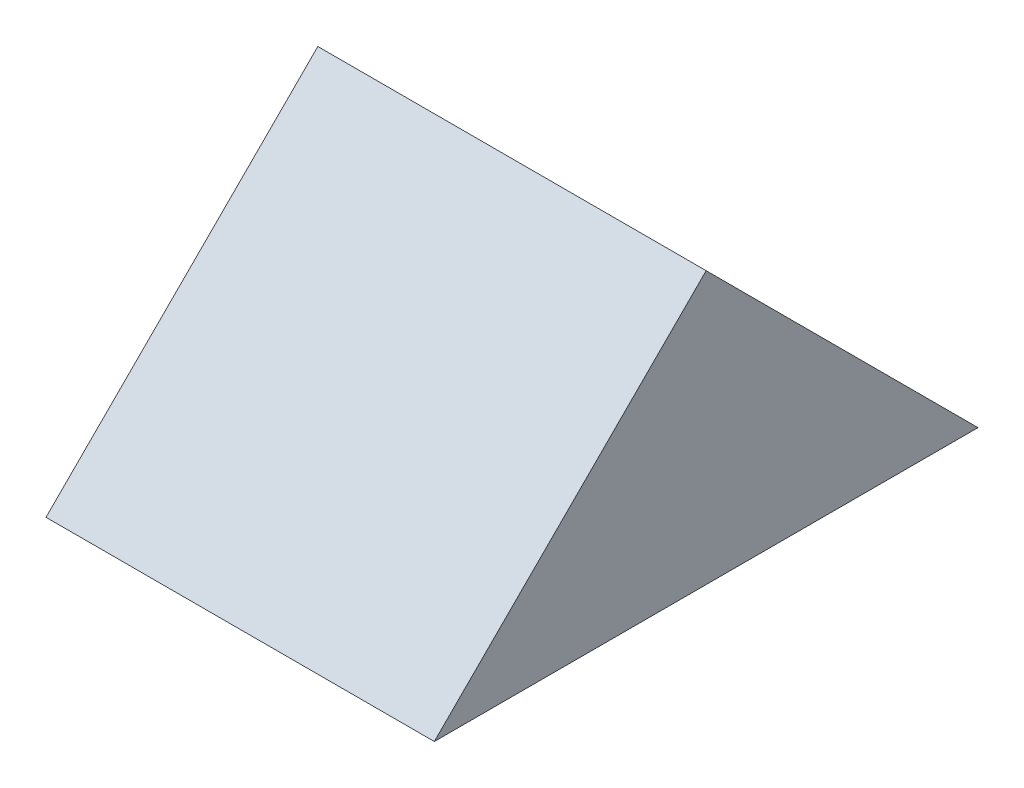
ISO-10303-21;
HEADER;
FILE_DESCRIPTION(('STEP AP214'),'2;1');
FILE_NAME('part.step','',(''),(''),'','','');
FILE_SCHEMA(('AUTOMOTIVE_DESIGN { 1 0 10303 214 1 1 1 1 }'));
ENDSEC;
DATA;
#1=APPLICATION_CONTEXT('core data for automotive mechanical design processes');
#2=APPLICATION_PROTOCOL_DEFINITION('international standard','automotive_design',2000,#1);
#3=PRODUCT_CONTEXT('',#1,'mechanical');
#4=PRODUCT('Part','Part','',(#3));
#5=PRODUCT_RELATED_PRODUCT_CATEGORY('part','',(#4));
#6=PRODUCT_DEFINITION_FORMATION('','',#4);
#7=PRODUCT_DEFINITION_CONTEXT('part definition',#1,'design');
#8=PRODUCT_DEFINITION('design','',#6,#7);
#9=PRODUCT_DEFINITION_SHAPE('','',#8);
#10=(LENGTH_UNIT() NAMED_UNIT(*) SI_UNIT(.MILLI.,.METRE.));
#11=(NAMED_UNIT(*) PLANE_ANGLE_UNIT() SI_UNIT($,.RADIAN.));
#12=(NAMED_UNIT(*) SI_UNIT($,.STERADIAN.) SOLID_ANGLE_UNIT());
#13=UNCERTAINTY_MEASURE_WITH_UNIT(LENGTH_MEASURE(1.E-05),#10,'distance_accuracy_value','');
#14=(GEOMETRIC_REPRESENTATION_CONTEXT(3) GLOBAL_UNCERTAINTY_ASSIGNED_CONTEXT((#13)) GLOBAL_UNIT_ASSIGNED_CONTEXT((#10,
#11,#12)) REPRESENTATION_CONTEXT('',''));
#15=CARTESIAN_POINT('',(0.,0.,0.));
#16=DIRECTION('',(0.,0.,1.));
#17=DIRECTION('',(1.,0.,0.));
#18=AXIS2_PLACEMENT_3D('',#15,#16,#17);
#19=CARTESIAN_POINT('',(12.5,0.,0.));
#20=DIRECTION('',(0.,1.,0.));
#21=DIRECTION('',(0.,0.,1.));
#22=AXIS2_PLACEMENT_3D('',#19,#20,#21);
#23=PLANE('',#22);
#24=DIRECTION('',(0.,0.,-1.));
#25=VECTOR('',#24,1.);
#26=CARTESIAN_POINT('',(-12.5,0.,0.));
#27=LINE('',#26,#25);
#28=CARTESIAN_POINT('',(-12.5,0.,17.5));
#29=VERTEX_POINT('',#28);
#30=CARTESIAN_POINT('',(-12.5,0.,-17.5));
#31=VERTEX_POINT('',#30);
#32=EDGE_CURVE('E81',#29,#31,#27,.T.);
#33=ORIENTED_EDGE('',*,*,#32,.T.);
#34=DIRECTION('',(-1.,0.,0.));
#35=VECTOR('',#34,1.);
#36=CARTESIAN_POINT('',(12.5,0.,-17.5));
#37=LINE('',#36,#35);
#38=CARTESIAN_POINT('',(12.5,0.,-17.5));
#39=VERTEX_POINT('',#38);
#40=EDGE_CURVE('E11',#39,#31,#37,.T.);
#41=ORIENTED_EDGE('',*,*,#40,.F.);
#42=DIRECTION('',(0.,0.,-1.));
#43=VECTOR('',#42,1.);
#44=CARTESIAN_POINT('',(12.5,0.,17.5));
#45=LINE('',#44,#43);
#46=CARTESIAN_POINT('',(12.5,0.,17.5));
#47=VERTEX_POINT('',#46);
#48=EDGE_CURVE('E85',#47,#39,#45,.T.);
#49=ORIENTED_EDGE('',*,*,#48,.F.);
#50=DIRECTION('',(-1.,0.,0.));
#51=VECTOR('',#50,1.);
#52=CARTESIAN_POINT('',(12.5,0.,17.5));
#53=LINE('',#52,#51);
#54=EDGE_CURVE('E100',#47,#29,#53,.T.);
#55=ORIENTED_EDGE('',*,*,#54,.T.);
#56=EDGE_LOOP('',(#33,#41,#49,#55));
#57=FACE_BOUND('',#56,.T.);
#58=ADVANCED_FACE('F36',(#57),#23,.F.);
#59=CARTESIAN_POINT('',(12.5,0.,-17.5));
#60=DIRECTION('',(0.,-0.707106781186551,0.707106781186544));
#61=DIRECTION('',(0.,-0.707106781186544,-0.707106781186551));
#62=AXIS2_PLACEMENT_3D('',#59,#60,#61);
#63=PLANE('',#62);
#64=DIRECTION('',(0.,0.707106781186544,0.707106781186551));
#65=VECTOR('',#64,1.);
#66=CARTESIAN_POINT('',(-12.5,0.,-17.5));
#67=LINE('',#66,#65);
#68=CARTESIAN_POINT('',(-12.5,17.5000000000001,2.56532362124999E-13));
#69=VERTEX_POINT('',#68);
#70=EDGE_CURVE('E74',#31,#69,#67,.T.);
#71=ORIENTED_EDGE('',*,*,#70,.T.);
#72=DIRECTION('',(-1.,0.,0.));
#73=VECTOR('',#72,1.);
#74=CARTESIAN_POINT('',(12.5,17.5000000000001,2.56532362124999E-13));
#75=LINE('',#74,#73);
#76=CARTESIAN_POINT('',(12.5,17.5000000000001,2.56532362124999E-13));
#77=VERTEX_POINT('',#76);
#78=EDGE_CURVE('E45',#77,#69,#75,.T.);
#79=ORIENTED_EDGE('',*,*,#78,.F.);
#80=DIRECTION('',(0.,0.707106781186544,0.707106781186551));
#81=VECTOR('',#80,1.);
#82=CARTESIAN_POINT('',(12.5,0.,-17.5));
#83=LINE('',#82,#81);
#84=EDGE_CURVE('E89',#39,#77,#83,.T.);
#85=ORIENTED_EDGE('',*,*,#84,.F.);
#86=ORIENTED_EDGE('',*,*,#40,.T.);
#87=EDGE_LOOP('',(#71,#79,#85,#86));
#88=FACE_BOUND('',#87,.T.);
#89=ADVANCED_FACE('F95',(#88),#63,.F.);
#90=CARTESIAN_POINT('',(12.5,17.5000000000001,2.56532362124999E-13));
#91=DIRECTION('',(0.,-0.707106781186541,-0.707106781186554));
#92=DIRECTION('',(0.,0.707106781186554,-0.707106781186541));
#93=AXIS2_PLACEMENT_3D('',#90,#91,#92);
#94=PLANE('',#93);
#95=DIRECTION('',(0.,-0.707106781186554,0.707106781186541));
#96=VECTOR('',#95,1.);
#97=CARTESIAN_POINT('',(-12.5,17.5000000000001,2.56532362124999E-13));
#98=LINE('',#97,#96);
#99=EDGE_CURVE('E93',#69,#29,#98,.T.);
#100=ORIENTED_EDGE('',*,*,#99,.T.);
#101=ORIENTED_EDGE('',*,*,#54,.F.);
#102=DIRECTION('',(0.,-0.707106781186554,0.707106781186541));
#103=VECTOR('',#102,1.);
#104=CARTESIAN_POINT('',(12.5,17.5000000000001,2.56532362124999E-13));
#105=LINE('',#104,#103);
#106=EDGE_CURVE('E57',#77,#47,#105,.T.);
#107=ORIENTED_EDGE('',*,*,#106,.F.);
#108=ORIENTED_EDGE('',*,*,#78,.T.);
#109=EDGE_LOOP('',(#100,#101,#107,#108));
#110=FACE_BOUND('',#109,.T.);
#111=ADVANCED_FACE('F112',(#110),#94,.F.);
#112=CARTESIAN_POINT('',(12.5,0.,0.));
#113=DIRECTION('',(1.,0.,0.));
#114=DIRECTION('',(0.,0.,-1.));
#115=AXIS2_PLACEMENT_3D('',#112,#113,#114);
#116=PLANE('',#115);
#117=ORIENTED_EDGE('',*,*,#48,.T.);
#118=ORIENTED_EDGE('',*,*,#84,.T.);
#119=ORIENTED_EDGE('',*,*,#106,.T.);
#120=EDGE_LOOP('',(#117,#118,#119));
#121=FACE_BOUND('',#120,.T.);
#122=ADVANCED_FACE('F87',(#121),#116,.T.);
#123=CARTESIAN_POINT('',(-12.5,0.,0.));
#124=DIRECTION('',(1.,0.,0.));
#125=DIRECTION('',(0.,0.,-1.));
#126=AXIS2_PLACEMENT_3D('',#123,#124,#125);
#127=PLANE('',#126);
#128=ORIENTED_EDGE('',*,*,#32,.F.);
#129=ORIENTED_EDGE('',*,*,#99,.F.);
#130=ORIENTED_EDGE('',*,*,#70,.F.);
#131=EDGE_LOOP('',(#128,#129,#130));
#132=FACE_BOUND('',#131,.T.);
#133=ADVANCED_FACE('F113',(#132),#127,.F.);
#134=CLOSED_SHELL('',(#58,#89,#111,#122,#133));
#135=MANIFOLD_SOLID_BREP('B2',#134);
#136=ADVANCED_BREP_SHAPE_REPRESENTATION('',(#18,#135),#14);
#137=SHAPE_DEFINITION_REPRESENTATION(#9,#136);
ENDSEC;
END-ISO-10303-21;
